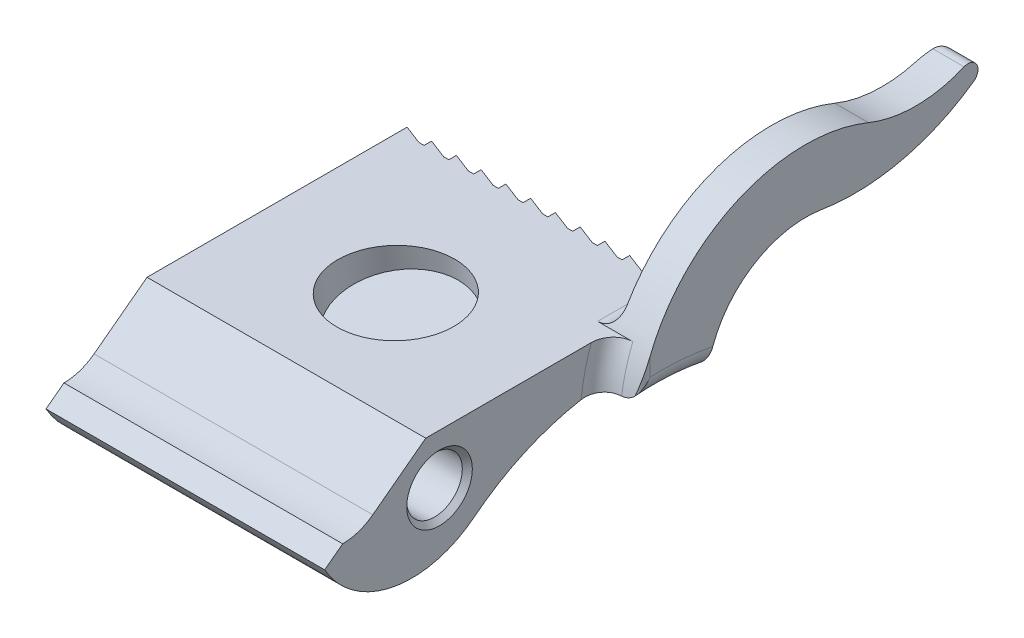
from build123d import *

# Parameters (mm, degrees)
EXTRUDE_START       = 11.1506
SKETCH_1_R          = 2.20345
EXTRUDE_1_DEPTH     = 22.098
EXTRUDE_START_2     = 25.146
EXTRUDE_2_DEPTH     = 5.55625
CUT_EXTRUDE_1_DEPTH = 5.55625
FILLET_1_R          = 1.5875
SKETCH_4_W          = 25.908140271
SKETCH_4_H          = 8.1534
CUT_EXTRUDE_2_DEPTH = 2.88925
FILLET_3_R          = 1.5875
CUT_EXTRUDE_3_DEPTH = 12.7
CHAMFER_1_SIZE      = 0.396875
CUT_EXTRUDE_8_DEPTH = 44.411194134
CUT_EXTRUDE_9_REACH = 50.489


with BuildPart() as part:
    # Sketch 1 → Extrude 1 (new body)
    with BuildSketch(Plane(origin=(0, 0, 0), x_dir=(0, 0, -1), z_dir=(1, 0, 0)).offset(EXTRUDE_START)):
        with BuildLine():
            Line((-9.106881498, -1.074154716), (-7.681430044, 0))
            ThreePointArc((-7.681430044, 0), (-6.422127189, 0.205090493), (-5.292976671, 0.799165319))
            Line((-5.292976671, 0.799165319), (-1.095222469, 3.9624))
            Line((-1.095222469, 3.9624), (19.525444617, 3.9624))
            Line((19.525444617, 3.9624), (20.019196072, -0.058882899))
            ThreePointArc((20.019196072, -0.058882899), (10.969596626, 0.392943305), (2.734902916, -3.387164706))
            ThreePointArc((2.734902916, -3.387164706), (-3.718745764, -4.958182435), (-9.106881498, -1.074154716))
        make_face()
        Circle(SKETCH_1_R, mode=Mode.SUBTRACT)
    extrude(amount=-EXTRUDE_1_DEPTH)

    # Sketch 2 → Extrude 2 (add)
    with BuildSketch(Plane(origin=(-10.9474, 0, 0), x_dir=(0, 0, -1), z_dir=(1, 0, 0)).offset(EXTRUDE_START_2)):
        with BuildLine():
            ThreePointArc((12.8524, 0.658855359), (15.554693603, 0.711222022), (18.2372, 0.380627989))
            ThreePointArc((18.2372, 0.380627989), (21.359132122, 5.58861108), (27.262263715, 7.010787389))
            ThreePointArc((27.262263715, 7.010787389), (33.559008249, 7.216835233), (39.312413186, 9.783891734))
            ThreePointArc((39.312413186, 9.783891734), (39.549694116, 10.818201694), (38.54647638, 11.164111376))
            ThreePointArc((38.54647638, 11.164111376), (34.758558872, 10.385900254), (30.962822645, 11.125033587))
            ThreePointArc((30.962822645, 11.125033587), (19.335019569, 10.343495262), (12.8524, 0.658855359))
        make_face()
    extrude(amount=-EXTRUDE_2_DEPTH)

    # Sketch 3 → Cut-Extrude 1 (cut)
    with BuildSketch(Plane.ZY.offset(-14.1986)):
        with BuildLine():
            Line((-20.019196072, -0.058882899), (-19.553710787, 3.732190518))
            ThreePointArc((-19.553710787, 3.732190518), (-18.700650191, 2.132929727), (-18.2372, 0.380627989))
            ThreePointArc((-18.2372, 0.380627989), (-19.133494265, 0.182346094), (-20.019196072, -0.058882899))
        make_face()
    extrude(amount=CUT_EXTRUDE_1_DEPTH, mode=Mode.SUBTRACT)

    # Fillet 1
    fillet_1_edges = [part.edges().sort_by_distance(p)[0] for p in [
        (11.1506, 2.339527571, -13.189420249),
    ]]
    fillet(fillet_1_edges, radius=FILLET_1_R)

    # Sketch 4 → Cut-Extrude 2 (cut)
    with BuildSketch(Plane(origin=(8.64235, 0, 0), x_dir=(0, 0, -1), z_dir=(1, 0, 0))):
        with Locations((26.695329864, 8.0391)):
            Rectangle(SKETCH_4_W, SKETCH_4_H)
    extrude(amount=CUT_EXTRUDE_2_DEPTH, mode=Mode.SUBTRACT)

    # Fillet 3
    fillet_3_edges = [part.edges().sort_by_distance(p)[0] for p in [
        (11.5316, 3.9624, -16.730324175),
        (14.1986, 0.711222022, -15.554693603),
    ]]
    fillet(fillet_3_edges, radius=FILLET_3_R)

    # Sketch 5 → Cut-Extrude 3 (cut, symmetric)
    with BuildSketch(Plane(origin=(0, 3.9624, 0), x_dir=(1, 0, 0), z_dir=(0, 1, 0))):
        with BuildLine():
            Line((14.1986, 13.646842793), (14.1986, 12.853092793))
            Line((14.1986, 12.853092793), (13.40485, 12.853092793))
            ThreePointArc((13.40485, 12.853092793), (13.966116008, 13.085576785), (14.1986, 13.646842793))
        make_face()
        with BuildLine():
            Line((12.32535, 39.6494), (11.5316, 39.6494))
            Line((11.5316, 39.6494), (11.5316, 37.40433597))
            ThreePointArc((11.5316, 37.40433597), (11.735878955, 38.59496097), (12.32535, 39.6494))
        make_face()
    extrude(amount=CUT_EXTRUDE_3_DEPTH, both=True, mode=Mode.SUBTRACT)

    # Chamfer 1
    chamfer_1_edges = [part.edges().sort_by_distance(p)[0] for p in [
        (-10.9474, 0, 2.20345),
        (11.1506, 0, 2.20345),
    ]]
    chamfer(chamfer_1_edges, length=CHAMFER_1_SIZE)

    # Sketch 6 → Cut-Extrude 8 (cut, through all, along a direction that is not the sketch's normal)
    with BuildSketch(Plane(origin=(0, 3.9624, 0), x_dir=(1, 0, 0), z_dir=(0, 1, 0))):
        Polygon((-10.9474, 19.525444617), (-9.425506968, 18.941244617), (-9.017, 18.941244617), (-9.017, 19.525444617), align=None)
        Polygon((-8.98398, 19.525444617), (-7.462086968, 18.941244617), (-7.05358, 18.941244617), (-7.05358, 19.525444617), align=None)
        Polygon((-7.02056, 19.525444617), (-5.498666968, 18.941244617), (-5.09016, 18.941244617), (-5.09016, 19.525444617), align=None)
        Polygon((-5.05714, 19.525444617), (-3.535246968, 18.941244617), (-3.12674, 18.941244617), (-3.12674, 19.525444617), align=None)
        Polygon((-3.09372, 19.525444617), (-1.571826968, 18.941244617), (-1.16332, 18.941244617), (-1.16332, 19.525444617), align=None)
        Polygon((-1.1303, 19.525444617), (0.391593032, 18.941244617), (0.8001, 18.941244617), (0.8001, 19.525444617), align=None)
        Polygon((0.83312, 19.525444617), (2.355013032, 18.941244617), (2.76352, 18.941244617), (2.76352, 19.525444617), align=None)
        Polygon((2.79654, 19.525444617), (4.318433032, 18.941244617), (4.72694, 18.941244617), (4.72694, 19.525444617), align=None)
        Polygon((4.75996, 19.525444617), (6.281853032, 18.941244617), (6.69036, 18.941244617), (6.69036, 19.525444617), align=None)
        Polygon((6.72338, 19.525444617), (8.245273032, 18.941244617), (8.65378, 18.941244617), (8.65378, 19.525444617), align=None)
    extrude(amount=-CUT_EXTRUDE_8_DEPTH, dir=(0, 0.9925461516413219, 0.1218693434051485), mode=Mode.SUBTRACT)

    # Cut-Extrude 9: up to this face of the body (flat: up to its plane)
    cut_extrude_9_end = Plane(part.part.faces().sort_by_distance((8.65378, 3.611619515, -19.213233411))[0])
    # Sketch 7 → Cut-Extrude 9 (cut, up to the picked face)
    with BuildSketch(Plane.ZY.offset(10.9474), mode=Mode.PRIVATE) as cut_extrude_9_sk1:
        Polygon((-19.786647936, 1.83506968), (-19.942196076, 0.568231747), (-19.304697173, 0.966585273), (-19.264455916, 1.294324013), align=None)
    cut_extrude_9_tool1 = split(extrude(cut_extrude_9_sk1.sketch, amount=-CUT_EXTRUDE_9_REACH, mode=Mode.PRIVATE), bisect_by=cut_extrude_9_end, keep=Keep.BOTH, mode=Mode.PRIVATE)
    # Sketch 7 → Cut-Extrude 9 (cut, up to the picked face)
    with BuildSketch(Plane.ZY.offset(10.9474), mode=Mode.PRIVATE) as cut_extrude_9_sk2:
        Polygon((-19.569964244, 3.599816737), (-19.725512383, 2.332978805), (-19.08801348, 2.731332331), (-19.047772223, 3.05907107), align=None)
    cut_extrude_9_tool2 = split(extrude(cut_extrude_9_sk2.sketch, amount=-CUT_EXTRUDE_9_REACH, mode=Mode.PRIVATE), bisect_by=cut_extrude_9_end, keep=Keep.BOTH, mode=Mode.PRIVATE)
    add(cut_extrude_9_tool1.solids().sort_by(Axis((-10.9474, 1.173041, -19.631414), (1, 0, 0)))[0], mode=Mode.SUBTRACT)
    add(cut_extrude_9_tool2.solids().sort_by(Axis((-10.9474, 2.937788, -19.414731), (1, 0, 0)))[0], mode=Mode.SUBTRACT)

    # Sketch 8 → Cut-Revolve 1 (revolve, cut)
    with BuildSketch(Plane(origin=(0, 0, 0), x_dir=(0, 0, -1), z_dir=(1, 0, 0))):
        Polygon((8.104354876, 1.576569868), (12.63191004, 2.3749), (11.795348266, 7.119277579), (7.267793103, 6.320947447), align=None)
    revolve(axis=Axis((0, -1.814369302, -8.702268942), (0, 0.9848077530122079, 0.17364817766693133)), mode=Mode.SUBTRACT)


solid = part.part
